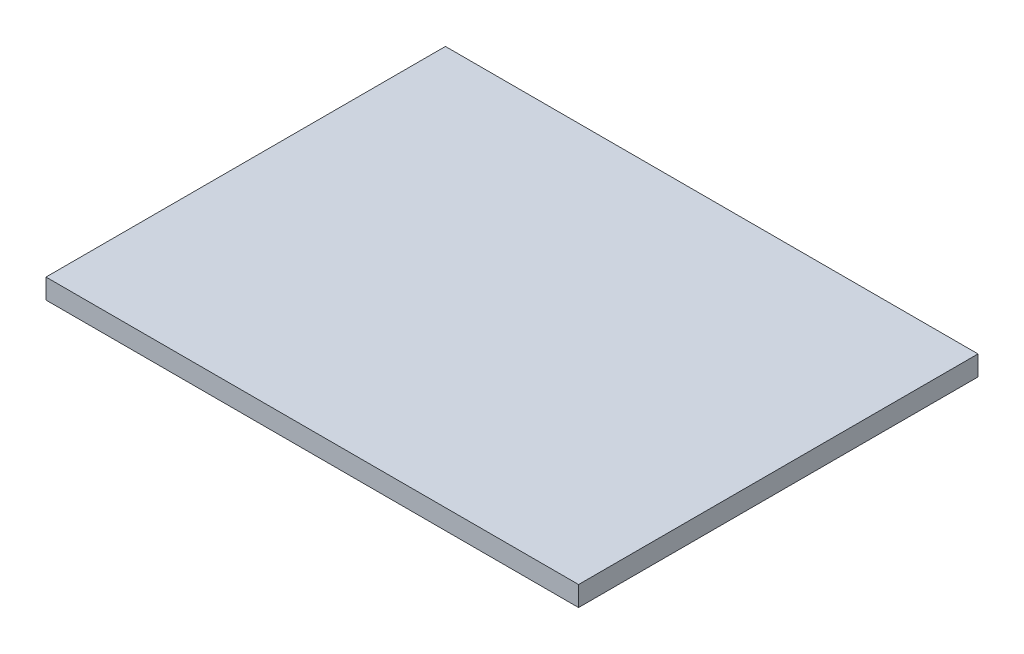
from build123d import *

# Parameters (mm, degrees)
SKETCH1_W           = 400
SKETCH1_H           = 300
BOSS_EXTRUDE2_DEPTH = 15


with BuildPart() as part:
    # Sketch1 → Boss-Extrude2 (new body)
    with BuildSketch(Plane(origin=(0, 0, 0), x_dir=(1, 0, 0), z_dir=(0, 1, 0))):
        Rectangle(SKETCH1_W, SKETCH1_H)
    extrude(amount=BOSS_EXTRUDE2_DEPTH)


solid = part.part
